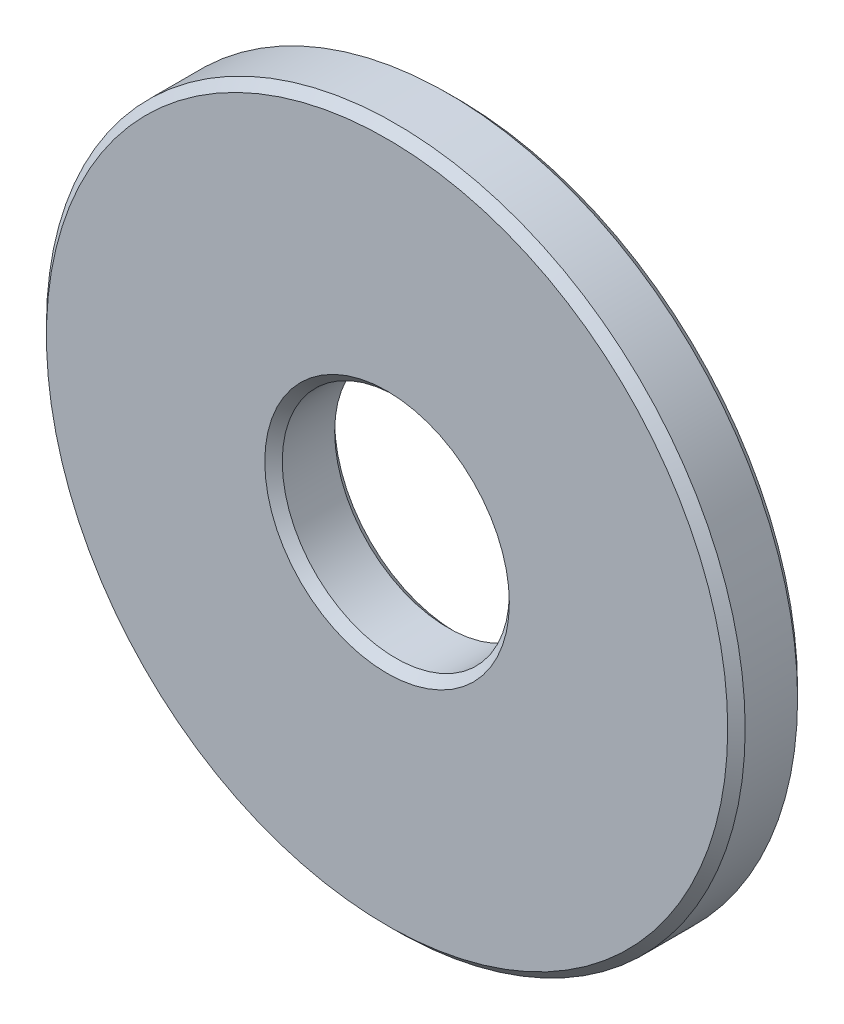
from build123d import *

# Parameters (mm, degrees)
ESQUISSE1_R     = 10
ESQUISSE1_R_2   = 3.25
RONDELLE_DEPTH  = 2
CHANF_0_25_SIZE = 0.25


with BuildPart() as part:
    # Esquisse1 → Rondelle (new body)
    with BuildSketch(Plane.XY):
        Circle(ESQUISSE1_R)
        Circle(ESQUISSE1_R_2, mode=Mode.SUBTRACT)
    extrude(amount=-RONDELLE_DEPTH)

    # Chanf 0.25
    chanf_0_25_edges = [part.edges().sort_by_distance(p)[0] for p in [
        (-10, 0, 0),
        (-10, 0, -2),
        (-3.25, 0, 0),
        (-3.25, 0, -2),
    ]]
    chamfer(chanf_0_25_edges, length=CHANF_0_25_SIZE)


solid = part.part
